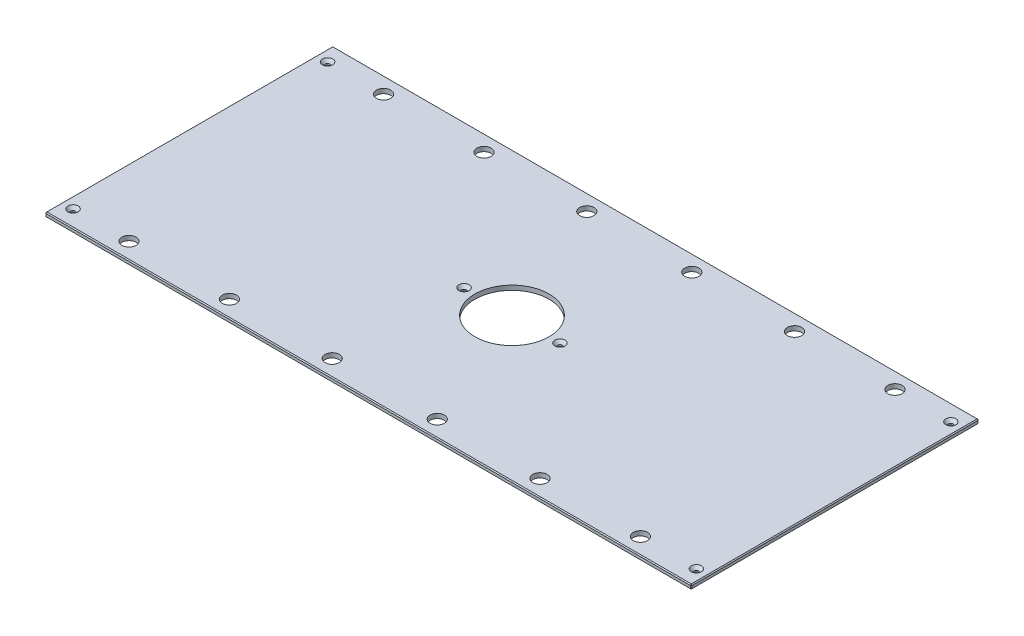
ISO-10303-21;
HEADER;
FILE_DESCRIPTION(('STEP AP214'),'2;1');
FILE_NAME('part.step','',(''),(''),'','','');
FILE_SCHEMA(('AUTOMOTIVE_DESIGN { 1 0 10303 214 1 1 1 1 }'));
ENDSEC;
DATA;
#1=APPLICATION_CONTEXT('core data for automotive mechanical design processes');
#2=APPLICATION_PROTOCOL_DEFINITION('international standard','automotive_design',2000,#1);
#3=PRODUCT_CONTEXT('',#1,'mechanical');
#4=PRODUCT('Part','Part','',(#3));
#5=PRODUCT_RELATED_PRODUCT_CATEGORY('part','',(#4));
#6=PRODUCT_DEFINITION_FORMATION('','',#4);
#7=PRODUCT_DEFINITION_CONTEXT('part definition',#1,'design');
#8=PRODUCT_DEFINITION('design','',#6,#7);
#9=PRODUCT_DEFINITION_SHAPE('','',#8);
#10=(LENGTH_UNIT() NAMED_UNIT(*) SI_UNIT(.MILLI.,.METRE.));
#11=(NAMED_UNIT(*) PLANE_ANGLE_UNIT() SI_UNIT($,.RADIAN.));
#12=(NAMED_UNIT(*) SI_UNIT($,.STERADIAN.) SOLID_ANGLE_UNIT());
#13=UNCERTAINTY_MEASURE_WITH_UNIT(LENGTH_MEASURE(1.E-05),#10,'distance_accuracy_value','');
#14=(GEOMETRIC_REPRESENTATION_CONTEXT(3) GLOBAL_UNCERTAINTY_ASSIGNED_CONTEXT((#13)) GLOBAL_UNIT_ASSIGNED_CONTEXT((#10,
#11,#12)) REPRESENTATION_CONTEXT('',''));
#15=CARTESIAN_POINT('',(0.,0.,0.));
#16=DIRECTION('',(0.,0.,1.));
#17=DIRECTION('',(1.,0.,0.));
#18=AXIS2_PLACEMENT_3D('',#15,#16,#17);
#19=CARTESIAN_POINT('',(-449.2625,6.35,-200.025));
#20=DIRECTION('',(1.,0.,0.));
#21=DIRECTION('',(0.,0.,-1.));
#22=AXIS2_PLACEMENT_3D('',#19,#20,#21);
#23=PLANE('',#22);
#24=DIRECTION('',(0.,0.,-1.));
#25=VECTOR('',#24,1.);
#26=CARTESIAN_POINT('',(-449.2625,5.08000000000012,-200.025));
#27=LINE('',#26,#25);
#28=CARTESIAN_POINT('',(-449.2625,5.08000000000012,198.755));
#29=VERTEX_POINT('',#28);
#30=CARTESIAN_POINT('',(-449.2625,5.08000000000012,-198.755));
#31=VERTEX_POINT('',#30);
#32=EDGE_CURVE('E136',#29,#31,#27,.T.);
#33=ORIENTED_EDGE('',*,*,#32,.T.);
#34=DIRECTION('',(0.,-1.,0.));
#35=VECTOR('',#34,1.);
#36=CARTESIAN_POINT('',(-449.2625,6.35,-198.755));
#37=LINE('',#36,#35);
#38=CARTESIAN_POINT('',(-449.2625,1.26999999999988,-198.755));
#39=VERTEX_POINT('',#38);
#40=EDGE_CURVE('E132',#31,#39,#37,.T.);
#41=ORIENTED_EDGE('',*,*,#40,.T.);
#42=DIRECTION('',(0.,0.,1.));
#43=VECTOR('',#42,1.);
#44=CARTESIAN_POINT('',(-449.2625,1.26999999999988,-200.025));
#45=LINE('',#44,#43);
#46=CARTESIAN_POINT('',(-449.2625,1.26999999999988,198.755));
#47=VERTEX_POINT('',#46);
#48=EDGE_CURVE('E127',#39,#47,#45,.T.);
#49=ORIENTED_EDGE('',*,*,#48,.T.);
#50=DIRECTION('',(0.,1.,0.));
#51=VECTOR('',#50,1.);
#52=CARTESIAN_POINT('',(-449.2625,6.35,198.755));
#53=LINE('',#52,#51);
#54=EDGE_CURVE('E129',#47,#29,#53,.T.);
#55=ORIENTED_EDGE('',*,*,#54,.T.);
#56=EDGE_LOOP('',(#33,#41,#49,#55));
#57=FACE_BOUND('',#56,.T.);
#58=ADVANCED_FACE('F36',(#57),#23,.F.);
#59=CARTESIAN_POINT('',(-449.2625,6.35,200.025));
#60=DIRECTION('',(0.,0.,-1.));
#61=DIRECTION('',(-1.,0.,0.));
#62=AXIS2_PLACEMENT_3D('',#59,#60,#61);
#63=PLANE('',#62);
#64=DIRECTION('',(1.,0.,0.));
#65=VECTOR('',#64,1.);
#66=CARTESIAN_POINT('',(-449.2625,1.26999999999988,200.025));
#67=LINE('',#66,#65);
#68=CARTESIAN_POINT('',(-447.9925,1.26999999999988,200.025));
#69=VERTEX_POINT('',#68);
#70=CARTESIAN_POINT('',(447.9925,1.26999999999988,200.025));
#71=VERTEX_POINT('',#70);
#72=EDGE_CURVE('E59',#69,#71,#67,.T.);
#73=ORIENTED_EDGE('',*,*,#72,.T.);
#74=DIRECTION('',(0.,1.,0.));
#75=VECTOR('',#74,1.);
#76=CARTESIAN_POINT('',(447.9925,6.35,200.025));
#77=LINE('',#76,#75);
#78=CARTESIAN_POINT('',(447.9925,5.08000000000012,200.025));
#79=VERTEX_POINT('',#78);
#80=EDGE_CURVE('E11',#71,#79,#77,.T.);
#81=ORIENTED_EDGE('',*,*,#80,.T.);
#82=DIRECTION('',(-1.,0.,0.));
#83=VECTOR('',#82,1.);
#84=CARTESIAN_POINT('',(-449.2625,5.08000000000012,200.025));
#85=LINE('',#84,#83);
#86=CARTESIAN_POINT('',(-447.9925,5.08000000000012,200.025));
#87=VERTEX_POINT('',#86);
#88=EDGE_CURVE('E45',#79,#87,#85,.T.);
#89=ORIENTED_EDGE('',*,*,#88,.T.);
#90=DIRECTION('',(0.,-1.,0.));
#91=VECTOR('',#90,1.);
#92=CARTESIAN_POINT('',(-447.9925,6.35,200.025));
#93=LINE('',#92,#91);
#94=EDGE_CURVE('E328',#87,#69,#93,.T.);
#95=ORIENTED_EDGE('',*,*,#94,.T.);
#96=EDGE_LOOP('',(#73,#81,#89,#95));
#97=FACE_BOUND('',#96,.T.);
#98=ADVANCED_FACE('F397',(#97),#63,.F.);
#99=CARTESIAN_POINT('',(449.2625,6.35,-200.025));
#100=DIRECTION('',(-1.,0.,0.));
#101=DIRECTION('',(0.,0.,1.));
#102=AXIS2_PLACEMENT_3D('',#99,#100,#101);
#103=PLANE('',#102);
#104=DIRECTION('',(0.,0.,-1.));
#105=VECTOR('',#104,1.);
#106=CARTESIAN_POINT('',(449.2625,1.26999999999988,-200.025));
#107=LINE('',#106,#105);
#108=CARTESIAN_POINT('',(449.2625,1.26999999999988,198.755));
#109=VERTEX_POINT('',#108);
#110=CARTESIAN_POINT('',(449.2625,1.26999999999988,-198.755));
#111=VERTEX_POINT('',#110);
#112=EDGE_CURVE('E323',#109,#111,#107,.T.);
#113=ORIENTED_EDGE('',*,*,#112,.T.);
#114=DIRECTION('',(0.,1.,0.));
#115=VECTOR('',#114,1.);
#116=CARTESIAN_POINT('',(449.2625,6.35,-198.755));
#117=LINE('',#116,#115);
#118=CARTESIAN_POINT('',(449.2625,5.08000000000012,-198.755));
#119=VERTEX_POINT('',#118);
#120=EDGE_CURVE('E325',#111,#119,#117,.T.);
#121=ORIENTED_EDGE('',*,*,#120,.T.);
#122=DIRECTION('',(0.,0.,1.));
#123=VECTOR('',#122,1.);
#124=CARTESIAN_POINT('',(449.2625,5.08000000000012,200.025));
#125=LINE('',#124,#123);
#126=CARTESIAN_POINT('',(449.2625,5.08000000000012,198.755));
#127=VERTEX_POINT('',#126);
#128=EDGE_CURVE('E321',#119,#127,#125,.T.);
#129=ORIENTED_EDGE('',*,*,#128,.T.);
#130=DIRECTION('',(0.,-1.,0.));
#131=VECTOR('',#130,1.);
#132=CARTESIAN_POINT('',(449.2625,6.35,198.755));
#133=LINE('',#132,#131);
#134=EDGE_CURVE('E319',#127,#109,#133,.T.);
#135=ORIENTED_EDGE('',*,*,#134,.T.);
#136=EDGE_LOOP('',(#113,#121,#129,#135));
#137=FACE_BOUND('',#136,.T.);
#138=ADVANCED_FACE('F384',(#137),#103,.F.);
#139=CARTESIAN_POINT('',(-449.2625,6.35,-200.025));
#140=DIRECTION('',(0.,0.,1.));
#141=DIRECTION('',(1.,0.,0.));
#142=AXIS2_PLACEMENT_3D('',#139,#140,#141);
#143=PLANE('',#142);
#144=DIRECTION('',(-1.,0.,0.));
#145=VECTOR('',#144,1.);
#146=CARTESIAN_POINT('',(-449.2625,1.26999999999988,-200.025));
#147=LINE('',#146,#145);
#148=CARTESIAN_POINT('',(447.9925,1.26999999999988,-200.025));
#149=VERTEX_POINT('',#148);
#150=CARTESIAN_POINT('',(-447.9925,1.26999999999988,-200.025));
#151=VERTEX_POINT('',#150);
#152=EDGE_CURVE('E295',#149,#151,#147,.T.);
#153=ORIENTED_EDGE('',*,*,#152,.T.);
#154=DIRECTION('',(0.,1.,0.));
#155=VECTOR('',#154,1.);
#156=CARTESIAN_POINT('',(-447.9925,6.35,-200.025));
#157=LINE('',#156,#155);
#158=CARTESIAN_POINT('',(-447.9925,5.08000000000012,-200.025));
#159=VERTEX_POINT('',#158);
#160=EDGE_CURVE('E299',#151,#159,#157,.T.);
#161=ORIENTED_EDGE('',*,*,#160,.T.);
#162=DIRECTION('',(1.,0.,0.));
#163=VECTOR('',#162,1.);
#164=CARTESIAN_POINT('',(449.2625,5.08000000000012,-200.025));
#165=LINE('',#164,#163);
#166=CARTESIAN_POINT('',(447.9925,5.08000000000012,-200.025));
#167=VERTEX_POINT('',#166);
#168=EDGE_CURVE('E297',#159,#167,#165,.T.);
#169=ORIENTED_EDGE('',*,*,#168,.T.);
#170=DIRECTION('',(0.,-1.,0.));
#171=VECTOR('',#170,1.);
#172=CARTESIAN_POINT('',(447.9925,6.35,-200.025));
#173=LINE('',#172,#171);
#174=EDGE_CURVE('E293',#167,#149,#173,.T.);
#175=ORIENTED_EDGE('',*,*,#174,.T.);
#176=EDGE_LOOP('',(#153,#161,#169,#175));
#177=FACE_BOUND('',#176,.T.);
#178=ADVANCED_FACE('F358',(#177),#143,.F.);
#179=CARTESIAN_POINT('',(0.,6.35,0.));
#180=DIRECTION('',(0.,1.,0.));
#181=DIRECTION('',(0.,0.,1.));
#182=AXIS2_PLACEMENT_3D('',#179,#180,#181);
#183=PLANE('',#182);
#184=CARTESIAN_POINT('',(433.3875,6.35,-177.00498));
#185=DIRECTION('',(0.,1.,0.));
#186=DIRECTION('',(0.,0.,1.));
#187=AXIS2_PLACEMENT_3D('',#184,#185,#186);
#188=CIRCLE('',#187,7.13740000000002);
#189=CARTESIAN_POINT('',(433.3875,6.35,-169.86758));
#190=VERTEX_POINT('',#189);
#191=EDGE_CURVE('E881',#190,#190,#188,.T.);
#192=ORIENTED_EDGE('',*,*,#191,.F.);
#193=EDGE_LOOP('',(#192));
#194=FACE_BOUND('',#193,.T.);
#195=CARTESIAN_POINT('',(433.3875,6.35,177.00498));
#196=DIRECTION('',(0.,1.,0.));
#197=DIRECTION('',(0.,0.,1.));
#198=AXIS2_PLACEMENT_3D('',#195,#196,#197);
#199=CIRCLE('',#198,7.13740000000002);
#200=CARTESIAN_POINT('',(433.3875,6.35,184.14238));
#201=VERTEX_POINT('',#200);
#202=EDGE_CURVE('E885',#201,#201,#199,.T.);
#203=ORIENTED_EDGE('',*,*,#202,.F.);
#204=EDGE_LOOP('',(#203));
#205=FACE_BOUND('',#204,.T.);
#206=CARTESIAN_POINT('',(-433.3875,6.35,177.00498));
#207=DIRECTION('',(0.,1.,0.));
#208=DIRECTION('',(0.,0.,1.));
#209=AXIS2_PLACEMENT_3D('',#206,#207,#208);
#210=CIRCLE('',#209,7.13740000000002);
#211=CARTESIAN_POINT('',(-433.3875,6.35,184.14238));
#212=VERTEX_POINT('',#211);
#213=EDGE_CURVE('E889',#212,#212,#210,.T.);
#214=ORIENTED_EDGE('',*,*,#213,.F.);
#215=EDGE_LOOP('',(#214));
#216=FACE_BOUND('',#215,.T.);
#217=CARTESIAN_POINT('',(-66.675,6.35,0.));
#218=DIRECTION('',(0.,1.,0.));
#219=DIRECTION('',(0.,0.,1.));
#220=AXIS2_PLACEMENT_3D('',#217,#218,#219);
#221=CIRCLE('',#220,7.1374);
#222=CARTESIAN_POINT('',(-66.675,6.35,7.1374));
#223=VERTEX_POINT('',#222);
#224=EDGE_CURVE('E893',#223,#223,#221,.T.);
#225=ORIENTED_EDGE('',*,*,#224,.F.);
#226=EDGE_LOOP('',(#225));
#227=FACE_BOUND('',#226,.T.);
#228=CARTESIAN_POINT('',(66.675,6.35,0.));
#229=DIRECTION('',(0.,1.,0.));
#230=DIRECTION('',(0.,0.,1.));
#231=AXIS2_PLACEMENT_3D('',#228,#229,#230);
#232=CIRCLE('',#231,7.1374);
#233=CARTESIAN_POINT('',(66.675,6.35,7.1374));
#234=VERTEX_POINT('',#233);
#235=EDGE_CURVE('E897',#234,#234,#232,.T.);
#236=ORIENTED_EDGE('',*,*,#235,.F.);
#237=EDGE_LOOP('',(#236));
#238=FACE_BOUND('',#237,.T.);
#239=CARTESIAN_POINT('',(-433.3875,6.35,-177.00498));
#240=DIRECTION('',(0.,1.,0.));
#241=DIRECTION('',(0.,0.,1.));
#242=AXIS2_PLACEMENT_3D('',#239,#240,#241);
#243=CIRCLE('',#242,7.13740000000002);
#244=CARTESIAN_POINT('',(-433.3875,6.35,-169.86758));
#245=VERTEX_POINT('',#244);
#246=EDGE_CURVE('E900',#245,#245,#243,.T.);
#247=ORIENTED_EDGE('',*,*,#246,.F.);
#248=EDGE_LOOP('',(#247));
#249=FACE_BOUND('',#248,.T.);
#250=DIRECTION('',(0.,0.,-1.));
#251=VECTOR('',#250,1.);
#252=CARTESIAN_POINT('',(447.9925,6.35,-200.025));
#253=LINE('',#252,#251);
#254=CARTESIAN_POINT('',(447.9925,6.35,198.755));
#255=VERTEX_POINT('',#254);
#256=CARTESIAN_POINT('',(447.9925,6.35,-198.755));
#257=VERTEX_POINT('',#256);
#258=EDGE_CURVE('E306',#255,#257,#253,.T.);
#259=ORIENTED_EDGE('',*,*,#258,.T.);
#260=DIRECTION('',(-1.,0.,0.));
#261=VECTOR('',#260,1.);
#262=CARTESIAN_POINT('',(-449.2625,6.35,-198.755));
#263=LINE('',#262,#261);
#264=CARTESIAN_POINT('',(-447.9925,6.35,-198.755));
#265=VERTEX_POINT('',#264);
#266=EDGE_CURVE('E308',#257,#265,#263,.T.);
#267=ORIENTED_EDGE('',*,*,#266,.T.);
#268=DIRECTION('',(0.,0.,1.));
#269=VECTOR('',#268,1.);
#270=CARTESIAN_POINT('',(-447.9925,6.35,200.025));
#271=LINE('',#270,#269);
#272=CARTESIAN_POINT('',(-447.9925,6.35,198.755));
#273=VERTEX_POINT('',#272);
#274=EDGE_CURVE('E304',#265,#273,#271,.T.);
#275=ORIENTED_EDGE('',*,*,#274,.T.);
#276=DIRECTION('',(1.,0.,0.));
#277=VECTOR('',#276,1.);
#278=CARTESIAN_POINT('',(449.2625,6.35,198.755));
#279=LINE('',#278,#277);
#280=EDGE_CURVE('E302',#273,#255,#279,.T.);
#281=ORIENTED_EDGE('',*,*,#280,.T.);
#282=EDGE_LOOP('',(#259,#267,#275,#281));
#283=FACE_BOUND('',#282,.T.);
#284=CARTESIAN_POINT('',(355.6,6.35,-177.00498));
#285=DIRECTION('',(0.,1.,0.));
#286=DIRECTION('',(0.,0.,1.));
#287=AXIS2_PLACEMENT_3D('',#284,#285,#286);
#288=CIRCLE('',#287,9.92187500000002);
#289=CARTESIAN_POINT('',(355.6,6.35,-167.083105));
#290=VERTEX_POINT('',#289);
#291=EDGE_CURVE('E205',#290,#290,#288,.T.);
#292=ORIENTED_EDGE('',*,*,#291,.F.);
#293=EDGE_LOOP('',(#292));
#294=FACE_BOUND('',#293,.T.);
#295=CARTESIAN_POINT('',(-355.6,6.35,-177.00498));
#296=DIRECTION('',(0.,1.,0.));
#297=DIRECTION('',(0.,0.,1.));
#298=AXIS2_PLACEMENT_3D('',#295,#296,#297);
#299=CIRCLE('',#298,9.92187500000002);
#300=CARTESIAN_POINT('',(-355.6,6.35,-167.083105));
#301=VERTEX_POINT('',#300);
#302=EDGE_CURVE('E215',#301,#301,#299,.T.);
#303=ORIENTED_EDGE('',*,*,#302,.F.);
#304=EDGE_LOOP('',(#303));
#305=FACE_BOUND('',#304,.T.);
#306=CARTESIAN_POINT('',(355.6,6.35,177.00498));
#307=DIRECTION('',(0.,1.,0.));
#308=DIRECTION('',(0.,0.,1.));
#309=AXIS2_PLACEMENT_3D('',#306,#307,#308);
#310=CIRCLE('',#309,9.92187500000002);
#311=CARTESIAN_POINT('',(355.6,6.35,186.926855));
#312=VERTEX_POINT('',#311);
#313=EDGE_CURVE('E226',#312,#312,#310,.T.);
#314=ORIENTED_EDGE('',*,*,#313,.F.);
#315=EDGE_LOOP('',(#314));
#316=FACE_BOUND('',#315,.T.);
#317=CARTESIAN_POINT('',(-355.6,6.35,177.00498));
#318=DIRECTION('',(0.,1.,0.));
#319=DIRECTION('',(0.,0.,1.));
#320=AXIS2_PLACEMENT_3D('',#317,#318,#319);
#321=CIRCLE('',#320,9.92187500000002);
#322=CARTESIAN_POINT('',(-355.6,6.35,186.926855));
#323=VERTEX_POINT('',#322);
#324=EDGE_CURVE('E232',#323,#323,#321,.T.);
#325=ORIENTED_EDGE('',*,*,#324,.F.);
#326=EDGE_LOOP('',(#325));
#327=FACE_BOUND('',#326,.T.);
#328=CARTESIAN_POINT('',(-215.9,6.35,-177.00498));
#329=DIRECTION('',(0.,1.,0.));
#330=DIRECTION('',(0.,0.,1.));
#331=AXIS2_PLACEMENT_3D('',#328,#329,#330);
#332=CIRCLE('',#331,9.921875);
#333=CARTESIAN_POINT('',(-215.9,6.35,-167.083105));
#334=VERTEX_POINT('',#333);
#335=EDGE_CURVE('E238',#334,#334,#332,.T.);
#336=ORIENTED_EDGE('',*,*,#335,.F.);
#337=EDGE_LOOP('',(#336));
#338=FACE_BOUND('',#337,.T.);
#339=CARTESIAN_POINT('',(215.9,6.35,-177.00498));
#340=DIRECTION('',(0.,1.,0.));
#341=DIRECTION('',(0.,0.,1.));
#342=AXIS2_PLACEMENT_3D('',#339,#340,#341);
#343=CIRCLE('',#342,9.921875);
#344=CARTESIAN_POINT('',(215.9,6.35,-167.083105));
#345=VERTEX_POINT('',#344);
#346=EDGE_CURVE('E244',#345,#345,#343,.T.);
#347=ORIENTED_EDGE('',*,*,#346,.F.);
#348=EDGE_LOOP('',(#347));
#349=FACE_BOUND('',#348,.T.);
#350=CARTESIAN_POINT('',(215.9,6.35,177.00498));
#351=DIRECTION('',(0.,1.,0.));
#352=DIRECTION('',(0.,0.,1.));
#353=AXIS2_PLACEMENT_3D('',#350,#351,#352);
#354=CIRCLE('',#353,9.921875);
#355=CARTESIAN_POINT('',(215.9,6.35,186.926855));
#356=VERTEX_POINT('',#355);
#357=EDGE_CURVE('E250',#356,#356,#354,.T.);
#358=ORIENTED_EDGE('',*,*,#357,.F.);
#359=EDGE_LOOP('',(#358));
#360=FACE_BOUND('',#359,.T.);
#361=CARTESIAN_POINT('',(-215.9,6.35,177.00498));
#362=DIRECTION('',(0.,1.,0.));
#363=DIRECTION('',(0.,0.,1.));
#364=AXIS2_PLACEMENT_3D('',#361,#362,#363);
#365=CIRCLE('',#364,9.921875);
#366=CARTESIAN_POINT('',(-215.9,6.35,186.926855));
#367=VERTEX_POINT('',#366);
#368=EDGE_CURVE('E256',#367,#367,#365,.T.);
#369=ORIENTED_EDGE('',*,*,#368,.F.);
#370=EDGE_LOOP('',(#369));
#371=FACE_BOUND('',#370,.T.);
#372=CARTESIAN_POINT('',(73.025,6.35,-177.00498));
#373=DIRECTION('',(0.,1.,0.));
#374=DIRECTION('',(0.,0.,1.));
#375=AXIS2_PLACEMENT_3D('',#372,#373,#374);
#376=CIRCLE('',#375,9.921875);
#377=CARTESIAN_POINT('',(73.025,6.35,-167.083105));
#378=VERTEX_POINT('',#377);
#379=EDGE_CURVE('E262',#378,#378,#376,.T.);
#380=ORIENTED_EDGE('',*,*,#379,.F.);
#381=EDGE_LOOP('',(#380));
#382=FACE_BOUND('',#381,.T.);
#383=CARTESIAN_POINT('',(-73.025,6.35,-177.00498));
#384=DIRECTION('',(0.,1.,0.));
#385=DIRECTION('',(0.,0.,1.));
#386=AXIS2_PLACEMENT_3D('',#383,#384,#385);
#387=CIRCLE('',#386,9.921875);
#388=CARTESIAN_POINT('',(-73.025,6.35,-167.083105));
#389=VERTEX_POINT('',#388);
#390=EDGE_CURVE('E268',#389,#389,#387,.T.);
#391=ORIENTED_EDGE('',*,*,#390,.F.);
#392=EDGE_LOOP('',(#391));
#393=FACE_BOUND('',#392,.T.);
#394=CARTESIAN_POINT('',(-73.025,6.35,177.00498));
#395=DIRECTION('',(0.,1.,0.));
#396=DIRECTION('',(0.,0.,1.));
#397=AXIS2_PLACEMENT_3D('',#394,#395,#396);
#398=CIRCLE('',#397,9.921875);
#399=CARTESIAN_POINT('',(-73.025,6.35,186.926855));
#400=VERTEX_POINT('',#399);
#401=EDGE_CURVE('E274',#400,#400,#398,.T.);
#402=ORIENTED_EDGE('',*,*,#401,.F.);
#403=EDGE_LOOP('',(#402));
#404=FACE_BOUND('',#403,.T.);
#405=CARTESIAN_POINT('',(73.025,6.35,177.00498));
#406=DIRECTION('',(0.,1.,0.));
#407=DIRECTION('',(0.,0.,1.));
#408=AXIS2_PLACEMENT_3D('',#405,#406,#407);
#409=CIRCLE('',#408,9.921875);
#410=CARTESIAN_POINT('',(73.025,6.35,186.926855));
#411=VERTEX_POINT('',#410);
#412=EDGE_CURVE('E280',#411,#411,#409,.T.);
#413=ORIENTED_EDGE('',*,*,#412,.F.);
#414=EDGE_LOOP('',(#413));
#415=FACE_BOUND('',#414,.T.);
#416=CARTESIAN_POINT('',(0.,6.35,0.));
#417=DIRECTION('',(0.,1.,0.));
#418=DIRECTION('',(0.,0.,1.));
#419=AXIS2_PLACEMENT_3D('',#416,#417,#418);
#420=CIRCLE('',#419,51.562);
#421=CARTESIAN_POINT('',(0.,6.35,51.562));
#422=VERTEX_POINT('',#421);
#423=EDGE_CURVE('E286',#422,#422,#420,.T.);
#424=ORIENTED_EDGE('',*,*,#423,.F.);
#425=EDGE_LOOP('',(#424));
#426=FACE_BOUND('',#425,.T.);
#427=ADVANCED_FACE('F406',(#194,#205,#216,#227,#238,#249,#283,#294,#305,#316,#327,#338,#349,
#360,#371,#382,#393,#404,#415,#426),#183,.T.);
#428=CARTESIAN_POINT('',(0.,0.,0.));
#429=DIRECTION('',(0.,1.,0.));
#430=DIRECTION('',(0.,0.,1.));
#431=AXIS2_PLACEMENT_3D('',#428,#429,#430);
#432=PLANE('',#431);
#433=CARTESIAN_POINT('',(433.3875,0.,-177.00498));
#434=DIRECTION('',(0.,1.,0.));
#435=DIRECTION('',(0.,0.,1.));
#436=AXIS2_PLACEMENT_3D('',#433,#434,#435);
#437=CIRCLE('',#436,3.3782);
#438=CARTESIAN_POINT('',(433.3875,0.,-173.62678));
#439=VERTEX_POINT('',#438);
#440=EDGE_CURVE('E934',#439,#439,#437,.T.);
#441=ORIENTED_EDGE('',*,*,#440,.T.);
#442=EDGE_LOOP('',(#441));
#443=FACE_BOUND('',#442,.T.);
#444=CARTESIAN_POINT('',(433.3875,0.,177.00498));
#445=DIRECTION('',(0.,1.,0.));
#446=DIRECTION('',(0.,0.,1.));
#447=AXIS2_PLACEMENT_3D('',#444,#445,#446);
#448=CIRCLE('',#447,3.3782);
#449=CARTESIAN_POINT('',(433.3875,0.,180.38318));
#450=VERTEX_POINT('',#449);
#451=EDGE_CURVE('E927',#450,#450,#448,.T.);
#452=ORIENTED_EDGE('',*,*,#451,.T.);
#453=EDGE_LOOP('',(#452));
#454=FACE_BOUND('',#453,.T.);
#455=CARTESIAN_POINT('',(-433.3875,0.,177.00498));
#456=DIRECTION('',(0.,1.,0.));
#457=DIRECTION('',(0.,0.,1.));
#458=AXIS2_PLACEMENT_3D('',#455,#456,#457);
#459=CIRCLE('',#458,3.3782);
#460=CARTESIAN_POINT('',(-433.3875,0.,180.38318));
#461=VERTEX_POINT('',#460);
#462=EDGE_CURVE('E920',#461,#461,#459,.T.);
#463=ORIENTED_EDGE('',*,*,#462,.T.);
#464=EDGE_LOOP('',(#463));
#465=FACE_BOUND('',#464,.T.);
#466=CARTESIAN_POINT('',(-66.675,0.,0.));
#467=DIRECTION('',(0.,1.,0.));
#468=DIRECTION('',(0.,0.,1.));
#469=AXIS2_PLACEMENT_3D('',#466,#467,#468);
#470=CIRCLE('',#469,3.3782);
#471=CARTESIAN_POINT('',(-66.675,0.,3.3782));
#472=VERTEX_POINT('',#471);
#473=EDGE_CURVE('E913',#472,#472,#470,.T.);
#474=ORIENTED_EDGE('',*,*,#473,.T.);
#475=EDGE_LOOP('',(#474));
#476=FACE_BOUND('',#475,.T.);
#477=CARTESIAN_POINT('',(66.675,0.,0.));
#478=DIRECTION('',(0.,1.,0.));
#479=DIRECTION('',(0.,0.,1.));
#480=AXIS2_PLACEMENT_3D('',#477,#478,#479);
#481=CIRCLE('',#480,3.3782);
#482=CARTESIAN_POINT('',(66.675,0.,3.3782));
#483=VERTEX_POINT('',#482);
#484=EDGE_CURVE('E903',#483,#483,#481,.T.);
#485=ORIENTED_EDGE('',*,*,#484,.T.);
#486=EDGE_LOOP('',(#485));
#487=FACE_BOUND('',#486,.T.);
#488=CARTESIAN_POINT('',(-433.3875,0.,-177.00498));
#489=DIRECTION('',(0.,1.,0.));
#490=DIRECTION('',(0.,0.,1.));
#491=AXIS2_PLACEMENT_3D('',#488,#489,#490);
#492=CIRCLE('',#491,3.3782);
#493=CARTESIAN_POINT('',(-433.3875,0.,-173.62678));
#494=VERTEX_POINT('',#493);
#495=EDGE_CURVE('E218',#494,#494,#492,.T.);
#496=ORIENTED_EDGE('',*,*,#495,.T.);
#497=EDGE_LOOP('',(#496));
#498=FACE_BOUND('',#497,.T.);
#499=DIRECTION('',(0.,0.,-1.));
#500=VECTOR('',#499,1.);
#501=CARTESIAN_POINT('',(-447.9925,0.,0.));
#502=LINE('',#501,#500);
#503=CARTESIAN_POINT('',(-447.9925,0.,198.755));
#504=VERTEX_POINT('',#503);
#505=CARTESIAN_POINT('',(-447.9925,0.,-198.755));
#506=VERTEX_POINT('',#505);
#507=EDGE_CURVE('E159',#504,#506,#502,.T.);
#508=ORIENTED_EDGE('',*,*,#507,.T.);
#509=DIRECTION('',(1.,0.,0.));
#510=VECTOR('',#509,1.);
#511=CARTESIAN_POINT('',(0.,0.,-198.755));
#512=LINE('',#511,#510);
#513=CARTESIAN_POINT('',(447.9925,0.,-198.755));
#514=VERTEX_POINT('',#513);
#515=EDGE_CURVE('E316',#506,#514,#512,.T.);
#516=ORIENTED_EDGE('',*,*,#515,.T.);
#517=DIRECTION('',(0.,0.,1.));
#518=VECTOR('',#517,1.);
#519=CARTESIAN_POINT('',(447.9925,0.,0.));
#520=LINE('',#519,#518);
#521=CARTESIAN_POINT('',(447.9925,0.,198.755));
#522=VERTEX_POINT('',#521);
#523=EDGE_CURVE('E314',#514,#522,#520,.T.);
#524=ORIENTED_EDGE('',*,*,#523,.T.);
#525=DIRECTION('',(-1.,0.,0.));
#526=VECTOR('',#525,1.);
#527=CARTESIAN_POINT('',(0.,0.,198.755));
#528=LINE('',#527,#526);
#529=EDGE_CURVE('E311',#522,#504,#528,.T.);
#530=ORIENTED_EDGE('',*,*,#529,.T.);
#531=EDGE_LOOP('',(#508,#516,#524,#530));
#532=FACE_BOUND('',#531,.T.);
#533=CARTESIAN_POINT('',(355.6,0.,-177.00498));
#534=DIRECTION('',(0.,1.,0.));
#535=DIRECTION('',(0.,0.,1.));
#536=AXIS2_PLACEMENT_3D('',#533,#534,#535);
#537=CIRCLE('',#536,9.92187499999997);
#538=CARTESIAN_POINT('',(355.6,0.,-167.083105));
#539=VERTEX_POINT('',#538);
#540=EDGE_CURVE('E210',#539,#539,#537,.T.);
#541=ORIENTED_EDGE('',*,*,#540,.T.);
#542=EDGE_LOOP('',(#541));
#543=FACE_BOUND('',#542,.T.);
#544=CARTESIAN_POINT('',(-355.6,0.,-177.00498));
#545=DIRECTION('',(0.,1.,0.));
#546=DIRECTION('',(0.,0.,1.));
#547=AXIS2_PLACEMENT_3D('',#544,#545,#546);
#548=CIRCLE('',#547,9.92187499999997);
#549=CARTESIAN_POINT('',(-355.6,0.,-167.083105));
#550=VERTEX_POINT('',#549);
#551=EDGE_CURVE('E223',#550,#550,#548,.T.);
#552=ORIENTED_EDGE('',*,*,#551,.T.);
#553=EDGE_LOOP('',(#552));
#554=FACE_BOUND('',#553,.T.);
#555=CARTESIAN_POINT('',(355.6,0.,177.00498));
#556=DIRECTION('',(0.,1.,0.));
#557=DIRECTION('',(0.,0.,1.));
#558=AXIS2_PLACEMENT_3D('',#555,#556,#557);
#559=CIRCLE('',#558,9.92187499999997);
#560=CARTESIAN_POINT('',(355.6,0.,186.926855));
#561=VERTEX_POINT('',#560);
#562=EDGE_CURVE('E229',#561,#561,#559,.T.);
#563=ORIENTED_EDGE('',*,*,#562,.T.);
#564=EDGE_LOOP('',(#563));
#565=FACE_BOUND('',#564,.T.);
#566=CARTESIAN_POINT('',(-355.6,0.,177.00498));
#567=DIRECTION('',(0.,1.,0.));
#568=DIRECTION('',(0.,0.,1.));
#569=AXIS2_PLACEMENT_3D('',#566,#567,#568);
#570=CIRCLE('',#569,9.92187499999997);
#571=CARTESIAN_POINT('',(-355.6,0.,186.926855));
#572=VERTEX_POINT('',#571);
#573=EDGE_CURVE('E235',#572,#572,#570,.T.);
#574=ORIENTED_EDGE('',*,*,#573,.T.);
#575=EDGE_LOOP('',(#574));
#576=FACE_BOUND('',#575,.T.);
#577=CARTESIAN_POINT('',(-215.9,0.,-177.00498));
#578=DIRECTION('',(0.,1.,0.));
#579=DIRECTION('',(0.,0.,1.));
#580=AXIS2_PLACEMENT_3D('',#577,#578,#579);
#581=CIRCLE('',#580,9.921875);
#582=CARTESIAN_POINT('',(-215.9,0.,-167.083105));
#583=VERTEX_POINT('',#582);
#584=EDGE_CURVE('E241',#583,#583,#581,.T.);
#585=ORIENTED_EDGE('',*,*,#584,.T.);
#586=EDGE_LOOP('',(#585));
#587=FACE_BOUND('',#586,.T.);
#588=CARTESIAN_POINT('',(215.9,0.,-177.00498));
#589=DIRECTION('',(0.,1.,0.));
#590=DIRECTION('',(0.,0.,1.));
#591=AXIS2_PLACEMENT_3D('',#588,#589,#590);
#592=CIRCLE('',#591,9.921875);
#593=CARTESIAN_POINT('',(215.9,0.,-167.083105));
#594=VERTEX_POINT('',#593);
#595=EDGE_CURVE('E247',#594,#594,#592,.T.);
#596=ORIENTED_EDGE('',*,*,#595,.T.);
#597=EDGE_LOOP('',(#596));
#598=FACE_BOUND('',#597,.T.);
#599=CARTESIAN_POINT('',(215.9,0.,177.00498));
#600=DIRECTION('',(0.,1.,0.));
#601=DIRECTION('',(0.,0.,1.));
#602=AXIS2_PLACEMENT_3D('',#599,#600,#601);
#603=CIRCLE('',#602,9.921875);
#604=CARTESIAN_POINT('',(215.9,0.,186.926855));
#605=VERTEX_POINT('',#604);
#606=EDGE_CURVE('E253',#605,#605,#603,.T.);
#607=ORIENTED_EDGE('',*,*,#606,.T.);
#608=EDGE_LOOP('',(#607));
#609=FACE_BOUND('',#608,.T.);
#610=CARTESIAN_POINT('',(-215.9,0.,177.00498));
#611=DIRECTION('',(0.,1.,0.));
#612=DIRECTION('',(0.,0.,1.));
#613=AXIS2_PLACEMENT_3D('',#610,#611,#612);
#614=CIRCLE('',#613,9.921875);
#615=CARTESIAN_POINT('',(-215.9,0.,186.926855));
#616=VERTEX_POINT('',#615);
#617=EDGE_CURVE('E259',#616,#616,#614,.T.);
#618=ORIENTED_EDGE('',*,*,#617,.T.);
#619=EDGE_LOOP('',(#618));
#620=FACE_BOUND('',#619,.T.);
#621=CARTESIAN_POINT('',(73.025,0.,-177.00498));
#622=DIRECTION('',(0.,1.,0.));
#623=DIRECTION('',(0.,0.,1.));
#624=AXIS2_PLACEMENT_3D('',#621,#622,#623);
#625=CIRCLE('',#624,9.921875);
#626=CARTESIAN_POINT('',(73.025,0.,-167.083105));
#627=VERTEX_POINT('',#626);
#628=EDGE_CURVE('E265',#627,#627,#625,.T.);
#629=ORIENTED_EDGE('',*,*,#628,.T.);
#630=EDGE_LOOP('',(#629));
#631=FACE_BOUND('',#630,.T.);
#632=CARTESIAN_POINT('',(-73.025,0.,-177.00498));
#633=DIRECTION('',(0.,1.,0.));
#634=DIRECTION('',(0.,0.,1.));
#635=AXIS2_PLACEMENT_3D('',#632,#633,#634);
#636=CIRCLE('',#635,9.921875);
#637=CARTESIAN_POINT('',(-73.025,0.,-167.083105));
#638=VERTEX_POINT('',#637);
#639=EDGE_CURVE('E271',#638,#638,#636,.T.);
#640=ORIENTED_EDGE('',*,*,#639,.T.);
#641=EDGE_LOOP('',(#640));
#642=FACE_BOUND('',#641,.T.);
#643=CARTESIAN_POINT('',(-73.025,0.,177.00498));
#644=DIRECTION('',(0.,1.,0.));
#645=DIRECTION('',(0.,0.,1.));
#646=AXIS2_PLACEMENT_3D('',#643,#644,#645);
#647=CIRCLE('',#646,9.921875);
#648=CARTESIAN_POINT('',(-73.025,0.,186.926855));
#649=VERTEX_POINT('',#648);
#650=EDGE_CURVE('E277',#649,#649,#647,.T.);
#651=ORIENTED_EDGE('',*,*,#650,.T.);
#652=EDGE_LOOP('',(#651));
#653=FACE_BOUND('',#652,.T.);
#654=CARTESIAN_POINT('',(73.025,0.,177.00498));
#655=DIRECTION('',(0.,1.,0.));
#656=DIRECTION('',(0.,0.,1.));
#657=AXIS2_PLACEMENT_3D('',#654,#655,#656);
#658=CIRCLE('',#657,9.921875);
#659=CARTESIAN_POINT('',(73.025,0.,186.926855));
#660=VERTEX_POINT('',#659);
#661=EDGE_CURVE('E283',#660,#660,#658,.T.);
#662=ORIENTED_EDGE('',*,*,#661,.T.);
#663=EDGE_LOOP('',(#662));
#664=FACE_BOUND('',#663,.T.);
#665=CARTESIAN_POINT('',(0.,0.,0.));
#666=DIRECTION('',(0.,1.,0.));
#667=DIRECTION('',(0.,0.,1.));
#668=AXIS2_PLACEMENT_3D('',#665,#666,#667);
#669=CIRCLE('',#668,51.562);
#670=CARTESIAN_POINT('',(0.,0.,51.562));
#671=VERTEX_POINT('',#670);
#672=EDGE_CURVE('E148',#671,#671,#669,.T.);
#673=ORIENTED_EDGE('',*,*,#672,.T.);
#674=EDGE_LOOP('',(#673));
#675=FACE_BOUND('',#674,.T.);
#676=ADVANCED_FACE('F371',(#443,#454,#465,#476,#487,#498,#532,#543,#554,#565,#576,#587,#598,
#609,#620,#631,#642,#653,#664,#675),#432,.F.);
#677=CARTESIAN_POINT('',(0.,0.,0.));
#678=DIRECTION('',(0.,1.,0.));
#679=DIRECTION('',(0.,0.,1.));
#680=AXIS2_PLACEMENT_3D('',#677,#678,#679);
#681=CYLINDRICAL_SURFACE('',#680,51.562);
#682=ORIENTED_EDGE('',*,*,#672,.F.);
#683=EDGE_LOOP('',(#682));
#684=FACE_BOUND('',#683,.T.);
#685=ORIENTED_EDGE('',*,*,#423,.T.);
#686=EDGE_LOOP('',(#685));
#687=FACE_BOUND('',#686,.T.);
#688=ADVANCED_FACE('F812',(#684,#687),#681,.F.);
#689=CARTESIAN_POINT('',(73.025,6.35,177.00498));
#690=DIRECTION('',(0.,1.,0.));
#691=DIRECTION('',(0.,0.,1.));
#692=AXIS2_PLACEMENT_3D('',#689,#690,#691);
#693=CYLINDRICAL_SURFACE('',#692,9.921875);
#694=ORIENTED_EDGE('',*,*,#661,.F.);
#695=EDGE_LOOP('',(#694));
#696=FACE_BOUND('',#695,.T.);
#697=ORIENTED_EDGE('',*,*,#412,.T.);
#698=EDGE_LOOP('',(#697));
#699=FACE_BOUND('',#698,.T.);
#700=ADVANCED_FACE('F803',(#696,#699),#693,.F.);
#701=CARTESIAN_POINT('',(-73.025,6.35,177.00498));
#702=DIRECTION('',(0.,1.,0.));
#703=DIRECTION('',(0.,0.,1.));
#704=AXIS2_PLACEMENT_3D('',#701,#702,#703);
#705=CYLINDRICAL_SURFACE('',#704,9.921875);
#706=ORIENTED_EDGE('',*,*,#650,.F.);
#707=EDGE_LOOP('',(#706));
#708=FACE_BOUND('',#707,.T.);
#709=ORIENTED_EDGE('',*,*,#401,.T.);
#710=EDGE_LOOP('',(#709));
#711=FACE_BOUND('',#710,.T.);
#712=ADVANCED_FACE('F794',(#708,#711),#705,.F.);
#713=CARTESIAN_POINT('',(-73.025,6.35,-177.00498));
#714=DIRECTION('',(0.,1.,0.));
#715=DIRECTION('',(0.,0.,1.));
#716=AXIS2_PLACEMENT_3D('',#713,#714,#715);
#717=CYLINDRICAL_SURFACE('',#716,9.921875);
#718=ORIENTED_EDGE('',*,*,#639,.F.);
#719=EDGE_LOOP('',(#718));
#720=FACE_BOUND('',#719,.T.);
#721=ORIENTED_EDGE('',*,*,#390,.T.);
#722=EDGE_LOOP('',(#721));
#723=FACE_BOUND('',#722,.T.);
#724=ADVANCED_FACE('F785',(#720,#723),#717,.F.);
#725=CARTESIAN_POINT('',(73.025,6.35,-177.00498));
#726=DIRECTION('',(0.,1.,0.));
#727=DIRECTION('',(0.,0.,1.));
#728=AXIS2_PLACEMENT_3D('',#725,#726,#727);
#729=CYLINDRICAL_SURFACE('',#728,9.921875);
#730=ORIENTED_EDGE('',*,*,#628,.F.);
#731=EDGE_LOOP('',(#730));
#732=FACE_BOUND('',#731,.T.);
#733=ORIENTED_EDGE('',*,*,#379,.T.);
#734=EDGE_LOOP('',(#733));
#735=FACE_BOUND('',#734,.T.);
#736=ADVANCED_FACE('F776',(#732,#735),#729,.F.);
#737=CARTESIAN_POINT('',(-215.9,6.35,177.00498));
#738=DIRECTION('',(0.,1.,0.));
#739=DIRECTION('',(0.,0.,1.));
#740=AXIS2_PLACEMENT_3D('',#737,#738,#739);
#741=CYLINDRICAL_SURFACE('',#740,9.921875);
#742=ORIENTED_EDGE('',*,*,#617,.F.);
#743=EDGE_LOOP('',(#742));
#744=FACE_BOUND('',#743,.T.);
#745=ORIENTED_EDGE('',*,*,#368,.T.);
#746=EDGE_LOOP('',(#745));
#747=FACE_BOUND('',#746,.T.);
#748=ADVANCED_FACE('F767',(#744,#747),#741,.F.);
#749=CARTESIAN_POINT('',(215.9,6.35,177.00498));
#750=DIRECTION('',(0.,1.,0.));
#751=DIRECTION('',(0.,0.,1.));
#752=AXIS2_PLACEMENT_3D('',#749,#750,#751);
#753=CYLINDRICAL_SURFACE('',#752,9.921875);
#754=ORIENTED_EDGE('',*,*,#606,.F.);
#755=EDGE_LOOP('',(#754));
#756=FACE_BOUND('',#755,.T.);
#757=ORIENTED_EDGE('',*,*,#357,.T.);
#758=EDGE_LOOP('',(#757));
#759=FACE_BOUND('',#758,.T.);
#760=ADVANCED_FACE('F758',(#756,#759),#753,.F.);
#761=CARTESIAN_POINT('',(215.9,6.35,-177.00498));
#762=DIRECTION('',(0.,1.,0.));
#763=DIRECTION('',(0.,0.,1.));
#764=AXIS2_PLACEMENT_3D('',#761,#762,#763);
#765=CYLINDRICAL_SURFACE('',#764,9.921875);
#766=ORIENTED_EDGE('',*,*,#595,.F.);
#767=EDGE_LOOP('',(#766));
#768=FACE_BOUND('',#767,.T.);
#769=ORIENTED_EDGE('',*,*,#346,.T.);
#770=EDGE_LOOP('',(#769));
#771=FACE_BOUND('',#770,.T.);
#772=ADVANCED_FACE('F749',(#768,#771),#765,.F.);
#773=CARTESIAN_POINT('',(-215.9,6.35,-177.00498));
#774=DIRECTION('',(0.,1.,0.));
#775=DIRECTION('',(0.,0.,1.));
#776=AXIS2_PLACEMENT_3D('',#773,#774,#775);
#777=CYLINDRICAL_SURFACE('',#776,9.921875);
#778=ORIENTED_EDGE('',*,*,#584,.F.);
#779=EDGE_LOOP('',(#778));
#780=FACE_BOUND('',#779,.T.);
#781=ORIENTED_EDGE('',*,*,#335,.T.);
#782=EDGE_LOOP('',(#781));
#783=FACE_BOUND('',#782,.T.);
#784=ADVANCED_FACE('F740',(#780,#783),#777,.F.);
#785=CARTESIAN_POINT('',(-355.6,6.35,177.00498));
#786=DIRECTION('',(0.,1.,0.));
#787=DIRECTION('',(0.,0.,1.));
#788=AXIS2_PLACEMENT_3D('',#785,#786,#787);
#789=CYLINDRICAL_SURFACE('',#788,9.921875);
#790=ORIENTED_EDGE('',*,*,#573,.F.);
#791=EDGE_LOOP('',(#790));
#792=FACE_BOUND('',#791,.T.);
#793=ORIENTED_EDGE('',*,*,#324,.T.);
#794=EDGE_LOOP('',(#793));
#795=FACE_BOUND('',#794,.T.);
#796=ADVANCED_FACE('F731',(#792,#795),#789,.F.);
#797=CARTESIAN_POINT('',(355.6,6.35,177.00498));
#798=DIRECTION('',(0.,1.,0.));
#799=DIRECTION('',(0.,0.,1.));
#800=AXIS2_PLACEMENT_3D('',#797,#798,#799);
#801=CYLINDRICAL_SURFACE('',#800,9.921875);
#802=ORIENTED_EDGE('',*,*,#562,.F.);
#803=EDGE_LOOP('',(#802));
#804=FACE_BOUND('',#803,.T.);
#805=ORIENTED_EDGE('',*,*,#313,.T.);
#806=EDGE_LOOP('',(#805));
#807=FACE_BOUND('',#806,.T.);
#808=ADVANCED_FACE('F722',(#804,#807),#801,.F.);
#809=CARTESIAN_POINT('',(-355.6,6.35,-177.00498));
#810=DIRECTION('',(0.,1.,0.));
#811=DIRECTION('',(0.,0.,1.));
#812=AXIS2_PLACEMENT_3D('',#809,#810,#811);
#813=CYLINDRICAL_SURFACE('',#812,9.921875);
#814=ORIENTED_EDGE('',*,*,#551,.F.);
#815=EDGE_LOOP('',(#814));
#816=FACE_BOUND('',#815,.T.);
#817=ORIENTED_EDGE('',*,*,#302,.T.);
#818=EDGE_LOOP('',(#817));
#819=FACE_BOUND('',#818,.T.);
#820=ADVANCED_FACE('F712',(#816,#819),#813,.F.);
#821=CARTESIAN_POINT('',(355.6,6.35,-177.00498));
#822=DIRECTION('',(0.,1.,0.));
#823=DIRECTION('',(0.,0.,1.));
#824=AXIS2_PLACEMENT_3D('',#821,#822,#823);
#825=CYLINDRICAL_SURFACE('',#824,9.921875);
#826=ORIENTED_EDGE('',*,*,#540,.F.);
#827=EDGE_LOOP('',(#826));
#828=FACE_BOUND('',#827,.T.);
#829=ORIENTED_EDGE('',*,*,#291,.T.);
#830=EDGE_LOOP('',(#829));
#831=FACE_BOUND('',#830,.T.);
#832=ADVANCED_FACE('F415',(#828,#831),#825,.F.);
#833=CARTESIAN_POINT('',(449.2625,6.35,198.755));
#834=DIRECTION('',(-0.707106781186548,0.,-0.707106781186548));
#835=DIRECTION('',(0.,-1.,0.));
#836=AXIS2_PLACEMENT_3D('',#833,#834,#835);
#837=PLANE('',#836);
#838=DIRECTION('',(-0.707106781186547,0.,0.707106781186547));
#839=VECTOR('',#838,1.);
#840=CARTESIAN_POINT('',(449.2625,5.08000000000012,198.755));
#841=LINE('',#840,#839);
#842=EDGE_CURVE('E40',#79,#127,#841,.F.);
#843=ORIENTED_EDGE('',*,*,#842,.F.);
#844=ORIENTED_EDGE('',*,*,#80,.F.);
#845=DIRECTION('',(0.707106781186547,0.,-0.707106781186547));
#846=VECTOR('',#845,1.);
#847=CARTESIAN_POINT('',(448.6275,1.26999999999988,199.39));
#848=LINE('',#847,#846);
#849=EDGE_CURVE('E198',#109,#71,#848,.F.);
#850=ORIENTED_EDGE('',*,*,#849,.F.);
#851=ORIENTED_EDGE('',*,*,#134,.F.);
#852=EDGE_LOOP('',(#843,#844,#850,#851));
#853=FACE_BOUND('',#852,.T.);
#854=ADVANCED_FACE('F38',(#853),#837,.F.);
#855=CARTESIAN_POINT('',(449.2625,5.08000000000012,198.755));
#856=DIRECTION('',(0.577350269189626,0.577350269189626,0.577350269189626));
#857=DIRECTION('',(0.707106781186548,0.,-0.707106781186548));
#858=AXIS2_PLACEMENT_3D('',#855,#856,#857);
#859=PLANE('',#858);
#860=DIRECTION('',(0.,-0.707106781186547,0.707106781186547));
#861=VECTOR('',#860,1.);
#862=CARTESIAN_POINT('',(447.9925,5.71500000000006,199.39));
#863=LINE('',#862,#861);
#864=EDGE_CURVE('E194',#79,#255,#863,.F.);
#865=ORIENTED_EDGE('',*,*,#864,.F.);
#866=ORIENTED_EDGE('',*,*,#842,.T.);
#867=DIRECTION('',(-0.707106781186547,0.707106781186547,0.));
#868=VECTOR('',#867,1.);
#869=CARTESIAN_POINT('',(449.2625,5.08000000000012,198.755));
#870=LINE('',#869,#868);
#871=EDGE_CURVE('E196',#255,#127,#870,.F.);
#872=ORIENTED_EDGE('',*,*,#871,.F.);
#873=EDGE_LOOP('',(#865,#866,#872));
#874=FACE_BOUND('',#873,.T.);
#875=ADVANCED_FACE('F408',(#874),#859,.T.);
#876=CARTESIAN_POINT('',(447.9925,0.,198.755));
#877=DIRECTION('',(0.577350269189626,-0.577350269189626,0.577350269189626));
#878=DIRECTION('',(0.707106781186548,0.,-0.707106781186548));
#879=AXIS2_PLACEMENT_3D('',#876,#877,#878);
#880=PLANE('',#879);
#881=DIRECTION('',(-0.707106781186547,-0.707106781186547,0.));
#882=VECTOR('',#881,1.);
#883=CARTESIAN_POINT('',(447.9925,0.,198.755));
#884=LINE('',#883,#882);
#885=EDGE_CURVE('E188',#109,#522,#884,.T.);
#886=ORIENTED_EDGE('',*,*,#885,.F.);
#887=ORIENTED_EDGE('',*,*,#849,.T.);
#888=DIRECTION('',(0.,0.707106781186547,0.707106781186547));
#889=VECTOR('',#888,1.);
#890=CARTESIAN_POINT('',(447.9925,0.,198.755));
#891=LINE('',#890,#889);
#892=EDGE_CURVE('E191',#522,#71,#891,.T.);
#893=ORIENTED_EDGE('',*,*,#892,.F.);
#894=EDGE_LOOP('',(#886,#887,#893));
#895=FACE_BOUND('',#894,.T.);
#896=ADVANCED_FACE('F377',(#895),#880,.T.);
#897=CARTESIAN_POINT('',(447.9925,6.35,0.));
#898=DIRECTION('',(0.707106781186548,0.707106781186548,0.));
#899=DIRECTION('',(0.,0.,1.));
#900=AXIS2_PLACEMENT_3D('',#897,#898,#899);
#901=PLANE('',#900);
#902=ORIENTED_EDGE('',*,*,#871,.T.);
#903=ORIENTED_EDGE('',*,*,#128,.F.);
#904=DIRECTION('',(0.707106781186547,-0.707106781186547,0.));
#905=VECTOR('',#904,1.);
#906=CARTESIAN_POINT('',(448.6275,5.71500000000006,-198.755));
#907=LINE('',#906,#905);
#908=EDGE_CURVE('E183',#257,#119,#907,.T.);
#909=ORIENTED_EDGE('',*,*,#908,.F.);
#910=ORIENTED_EDGE('',*,*,#258,.F.);
#911=EDGE_LOOP('',(#902,#903,#909,#910));
#912=FACE_BOUND('',#911,.T.);
#913=ADVANCED_FACE('F394',(#912),#901,.T.);
#914=CARTESIAN_POINT('',(0.,6.35,198.755));
#915=DIRECTION('',(0.,0.707106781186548,0.707106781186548));
#916=DIRECTION('',(-1.,0.,0.));
#917=AXIS2_PLACEMENT_3D('',#914,#915,#916);
#918=PLANE('',#917);
#919=ORIENTED_EDGE('',*,*,#864,.T.);
#920=ORIENTED_EDGE('',*,*,#280,.F.);
#921=DIRECTION('',(0.,0.707106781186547,-0.707106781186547));
#922=VECTOR('',#921,1.);
#923=CARTESIAN_POINT('',(-447.9925,6.35,198.755));
#924=LINE('',#923,#922);
#925=EDGE_CURVE('E180',#87,#273,#924,.T.);
#926=ORIENTED_EDGE('',*,*,#925,.F.);
#927=ORIENTED_EDGE('',*,*,#88,.F.);
#928=EDGE_LOOP('',(#919,#920,#926,#927));
#929=FACE_BOUND('',#928,.T.);
#930=ADVANCED_FACE('F399',(#929),#918,.T.);
#931=CARTESIAN_POINT('',(-447.9925,6.35,200.025));
#932=DIRECTION('',(0.707106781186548,0.,-0.707106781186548));
#933=DIRECTION('',(0.,-1.,0.));
#934=AXIS2_PLACEMENT_3D('',#931,#932,#933);
#935=PLANE('',#934);
#936=DIRECTION('',(0.707106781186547,0.,0.707106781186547));
#937=VECTOR('',#936,1.);
#938=CARTESIAN_POINT('',(-449.2625,1.26999999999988,198.755));
#939=LINE('',#938,#937);
#940=EDGE_CURVE('E143',#69,#47,#939,.F.);
#941=ORIENTED_EDGE('',*,*,#940,.F.);
#942=ORIENTED_EDGE('',*,*,#94,.F.);
#943=DIRECTION('',(-0.707106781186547,0.,-0.707106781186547));
#944=VECTOR('',#943,1.);
#945=CARTESIAN_POINT('',(-448.6275,5.08000000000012,199.39));
#946=LINE('',#945,#944);
#947=EDGE_CURVE('E146',#29,#87,#946,.F.);
#948=ORIENTED_EDGE('',*,*,#947,.F.);
#949=ORIENTED_EDGE('',*,*,#54,.F.);
#950=EDGE_LOOP('',(#941,#942,#948,#949));
#951=FACE_BOUND('',#950,.T.);
#952=ADVANCED_FACE('F141',(#951),#935,.F.);
#953=CARTESIAN_POINT('',(-449.2625,1.26999999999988,200.025));
#954=DIRECTION('',(0.,0.707106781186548,-0.707106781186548));
#955=DIRECTION('',(1.,0.,0.));
#956=AXIS2_PLACEMENT_3D('',#953,#954,#955);
#957=PLANE('',#956);
#958=ORIENTED_EDGE('',*,*,#892,.T.);
#959=ORIENTED_EDGE('',*,*,#72,.F.);
#960=DIRECTION('',(0.,-0.707106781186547,-0.707106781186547));
#961=VECTOR('',#960,1.);
#962=CARTESIAN_POINT('',(-447.9925,0.634999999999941,199.39));
#963=LINE('',#962,#961);
#964=EDGE_CURVE('E156',#504,#69,#963,.F.);
#965=ORIENTED_EDGE('',*,*,#964,.F.);
#966=ORIENTED_EDGE('',*,*,#529,.F.);
#967=EDGE_LOOP('',(#958,#959,#965,#966));
#968=FACE_BOUND('',#967,.T.);
#969=ADVANCED_FACE('F376',(#968),#957,.F.);
#970=CARTESIAN_POINT('',(449.2625,1.26999999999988,-200.025));
#971=DIRECTION('',(-0.707106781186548,0.707106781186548,0.));
#972=DIRECTION('',(0.,0.,-1.));
#973=AXIS2_PLACEMENT_3D('',#970,#971,#972);
#974=PLANE('',#973);
#975=ORIENTED_EDGE('',*,*,#885,.T.);
#976=ORIENTED_EDGE('',*,*,#523,.F.);
#977=DIRECTION('',(0.707106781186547,0.707106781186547,0.));
#978=VECTOR('',#977,1.);
#979=CARTESIAN_POINT('',(447.9925,0.,-198.755));
#980=LINE('',#979,#978);
#981=EDGE_CURVE('E175',#111,#514,#980,.F.);
#982=ORIENTED_EDGE('',*,*,#981,.F.);
#983=ORIENTED_EDGE('',*,*,#112,.F.);
#984=EDGE_LOOP('',(#975,#976,#982,#983));
#985=FACE_BOUND('',#984,.T.);
#986=ADVANCED_FACE('F381',(#985),#974,.F.);
#987=CARTESIAN_POINT('',(447.9925,6.35,-200.025));
#988=DIRECTION('',(-0.707106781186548,0.,0.707106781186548));
#989=DIRECTION('',(0.,-1.,0.));
#990=AXIS2_PLACEMENT_3D('',#987,#988,#989);
#991=PLANE('',#990);
#992=DIRECTION('',(0.707106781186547,0.,0.707106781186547));
#993=VECTOR('',#992,1.);
#994=CARTESIAN_POINT('',(447.9925,5.08000000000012,-200.025));
#995=LINE('',#994,#993);
#996=EDGE_CURVE('E185',#119,#167,#995,.F.);
#997=ORIENTED_EDGE('',*,*,#996,.F.);
#998=ORIENTED_EDGE('',*,*,#120,.F.);
#999=DIRECTION('',(-0.707106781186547,0.,-0.707106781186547));
#1000=VECTOR('',#999,1.);
#1001=CARTESIAN_POINT('',(448.6275,1.26999999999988,-199.39));
#1002=LINE('',#1001,#1000);
#1003=EDGE_CURVE('E172',#149,#111,#1002,.F.);
#1004=ORIENTED_EDGE('',*,*,#1003,.F.);
#1005=ORIENTED_EDGE('',*,*,#174,.F.);
#1006=EDGE_LOOP('',(#997,#998,#1004,#1005));
#1007=FACE_BOUND('',#1006,.T.);
#1008=ADVANCED_FACE('F389',(#1007),#991,.F.);
#1009=CARTESIAN_POINT('',(447.9925,5.08000000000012,-200.025));
#1010=DIRECTION('',(0.577350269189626,0.577350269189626,-0.577350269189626));
#1011=DIRECTION('',(-0.707106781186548,0.,-0.707106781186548));
#1012=AXIS2_PLACEMENT_3D('',#1009,#1010,#1011);
#1013=PLANE('',#1012);
#1014=ORIENTED_EDGE('',*,*,#908,.T.);
#1015=ORIENTED_EDGE('',*,*,#996,.T.);
#1016=DIRECTION('',(0.,0.707106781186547,0.707106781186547));
#1017=VECTOR('',#1016,1.);
#1018=CARTESIAN_POINT('',(447.9925,5.08000000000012,-200.025));
#1019=LINE('',#1018,#1017);
#1020=EDGE_CURVE('E164',#257,#167,#1019,.F.);
#1021=ORIENTED_EDGE('',*,*,#1020,.F.);
#1022=EDGE_LOOP('',(#1014,#1015,#1021));
#1023=FACE_BOUND('',#1022,.T.);
#1024=ADVANCED_FACE('F447',(#1023),#1013,.T.);
#1025=CARTESIAN_POINT('',(-447.9925,6.35,198.755));
#1026=DIRECTION('',(-0.577350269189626,0.577350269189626,0.577350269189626));
#1027=DIRECTION('',(0.707106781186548,0.,0.707106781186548));
#1028=AXIS2_PLACEMENT_3D('',#1025,#1026,#1027);
#1029=PLANE('',#1028);
#1030=ORIENTED_EDGE('',*,*,#947,.T.);
#1031=ORIENTED_EDGE('',*,*,#925,.T.);
#1032=DIRECTION('',(-0.707106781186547,-0.707106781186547,0.));
#1033=VECTOR('',#1032,1.);
#1034=CARTESIAN_POINT('',(-447.9925,6.35,198.755));
#1035=LINE('',#1034,#1033);
#1036=EDGE_CURVE('E160',#29,#273,#1035,.F.);
#1037=ORIENTED_EDGE('',*,*,#1036,.F.);
#1038=EDGE_LOOP('',(#1030,#1031,#1037));
#1039=FACE_BOUND('',#1038,.T.);
#1040=ADVANCED_FACE('F401',(#1039),#1029,.T.);
#1041=CARTESIAN_POINT('',(-449.2625,1.26999999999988,198.755));
#1042=DIRECTION('',(-0.577350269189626,-0.577350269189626,0.577350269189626));
#1043=DIRECTION('',(0.707106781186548,0.,0.707106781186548));
#1044=AXIS2_PLACEMENT_3D('',#1041,#1042,#1043);
#1045=PLANE('',#1044);
#1046=ORIENTED_EDGE('',*,*,#964,.T.);
#1047=ORIENTED_EDGE('',*,*,#940,.T.);
#1048=DIRECTION('',(-0.707106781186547,0.707106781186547,0.));
#1049=VECTOR('',#1048,1.);
#1050=CARTESIAN_POINT('',(-449.2625,1.26999999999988,198.755));
#1051=LINE('',#1050,#1049);
#1052=EDGE_CURVE('E153',#504,#47,#1051,.T.);
#1053=ORIENTED_EDGE('',*,*,#1052,.F.);
#1054=EDGE_LOOP('',(#1046,#1047,#1053));
#1055=FACE_BOUND('',#1054,.T.);
#1056=ADVANCED_FACE('F152',(#1055),#1045,.T.);
#1057=CARTESIAN_POINT('',(447.9925,0.,-198.755));
#1058=DIRECTION('',(0.577350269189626,-0.577350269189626,-0.577350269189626));
#1059=DIRECTION('',(-0.707106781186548,0.,-0.707106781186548));
#1060=AXIS2_PLACEMENT_3D('',#1057,#1058,#1059);
#1061=PLANE('',#1060);
#1062=ORIENTED_EDGE('',*,*,#1003,.T.);
#1063=ORIENTED_EDGE('',*,*,#981,.T.);
#1064=DIRECTION('',(0.,-0.707106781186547,0.707106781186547));
#1065=VECTOR('',#1064,1.);
#1066=CARTESIAN_POINT('',(447.9925,0.,-198.755));
#1067=LINE('',#1066,#1065);
#1068=EDGE_CURVE('E161',#149,#514,#1067,.T.);
#1069=ORIENTED_EDGE('',*,*,#1068,.F.);
#1070=EDGE_LOOP('',(#1062,#1063,#1069));
#1071=FACE_BOUND('',#1070,.T.);
#1072=ADVANCED_FACE('F439',(#1071),#1061,.T.);
#1073=CARTESIAN_POINT('',(0.,6.35,-198.755));
#1074=DIRECTION('',(0.,0.707106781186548,-0.707106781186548));
#1075=DIRECTION('',(1.,0.,0.));
#1076=AXIS2_PLACEMENT_3D('',#1073,#1074,#1075);
#1077=PLANE('',#1076);
#1078=ORIENTED_EDGE('',*,*,#1020,.T.);
#1079=ORIENTED_EDGE('',*,*,#168,.F.);
#1080=DIRECTION('',(0.,-0.707106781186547,-0.707106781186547));
#1081=VECTOR('',#1080,1.);
#1082=CARTESIAN_POINT('',(-447.9925,5.08000000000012,-200.025));
#1083=LINE('',#1082,#1081);
#1084=EDGE_CURVE('E166',#265,#159,#1083,.T.);
#1085=ORIENTED_EDGE('',*,*,#1084,.F.);
#1086=ORIENTED_EDGE('',*,*,#266,.F.);
#1087=EDGE_LOOP('',(#1078,#1079,#1085,#1086));
#1088=FACE_BOUND('',#1087,.T.);
#1089=ADVANCED_FACE('F353',(#1088),#1077,.T.);
#1090=CARTESIAN_POINT('',(-447.9925,6.35,0.));
#1091=DIRECTION('',(-0.707106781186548,0.707106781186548,0.));
#1092=DIRECTION('',(0.,0.,-1.));
#1093=AXIS2_PLACEMENT_3D('',#1090,#1091,#1092);
#1094=PLANE('',#1093);
#1095=ORIENTED_EDGE('',*,*,#1036,.T.);
#1096=ORIENTED_EDGE('',*,*,#274,.F.);
#1097=DIRECTION('',(0.707106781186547,0.707106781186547,0.));
#1098=VECTOR('',#1097,1.);
#1099=CARTESIAN_POINT('',(-448.6275,5.71500000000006,-198.755));
#1100=LINE('',#1099,#1098);
#1101=EDGE_CURVE('E342',#31,#265,#1100,.T.);
#1102=ORIENTED_EDGE('',*,*,#1101,.F.);
#1103=ORIENTED_EDGE('',*,*,#32,.F.);
#1104=EDGE_LOOP('',(#1095,#1096,#1102,#1103));
#1105=FACE_BOUND('',#1104,.T.);
#1106=ADVANCED_FACE('F404',(#1105),#1094,.T.);
#1107=CARTESIAN_POINT('',(-449.2625,1.26999999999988,-200.025));
#1108=DIRECTION('',(0.707106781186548,0.707106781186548,0.));
#1109=DIRECTION('',(0.,0.,1.));
#1110=AXIS2_PLACEMENT_3D('',#1107,#1108,#1109);
#1111=PLANE('',#1110);
#1112=ORIENTED_EDGE('',*,*,#1052,.T.);
#1113=ORIENTED_EDGE('',*,*,#48,.F.);
#1114=DIRECTION('',(0.707106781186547,-0.707106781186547,0.));
#1115=VECTOR('',#1114,1.);
#1116=CARTESIAN_POINT('',(-449.2625,1.26999999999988,-198.755));
#1117=LINE('',#1116,#1115);
#1118=EDGE_CURVE('E339',#506,#39,#1117,.F.);
#1119=ORIENTED_EDGE('',*,*,#1118,.F.);
#1120=ORIENTED_EDGE('',*,*,#507,.F.);
#1121=EDGE_LOOP('',(#1112,#1113,#1119,#1120));
#1122=FACE_BOUND('',#1121,.T.);
#1123=ADVANCED_FACE('F158',(#1122),#1111,.F.);
#1124=CARTESIAN_POINT('',(-449.2625,1.26999999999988,-200.025));
#1125=DIRECTION('',(0.,0.707106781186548,0.707106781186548));
#1126=DIRECTION('',(-1.,0.,0.));
#1127=AXIS2_PLACEMENT_3D('',#1124,#1125,#1126);
#1128=PLANE('',#1127);
#1129=ORIENTED_EDGE('',*,*,#1068,.T.);
#1130=ORIENTED_EDGE('',*,*,#515,.F.);
#1131=DIRECTION('',(0.,0.707106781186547,-0.707106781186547));
#1132=VECTOR('',#1131,1.);
#1133=CARTESIAN_POINT('',(-447.9925,0.634999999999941,-199.39));
#1134=LINE('',#1133,#1132);
#1135=EDGE_CURVE('E336',#151,#506,#1134,.F.);
#1136=ORIENTED_EDGE('',*,*,#1135,.F.);
#1137=ORIENTED_EDGE('',*,*,#152,.F.);
#1138=EDGE_LOOP('',(#1129,#1130,#1136,#1137));
#1139=FACE_BOUND('',#1138,.T.);
#1140=ADVANCED_FACE('F368',(#1139),#1128,.F.);
#1141=CARTESIAN_POINT('',(-447.9925,5.08000000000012,-200.025));
#1142=DIRECTION('',(-0.577350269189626,0.577350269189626,-0.577350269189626));
#1143=DIRECTION('',(-0.707106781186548,0.,0.707106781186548));
#1144=AXIS2_PLACEMENT_3D('',#1141,#1142,#1143);
#1145=PLANE('',#1144);
#1146=ORIENTED_EDGE('',*,*,#1101,.T.);
#1147=ORIENTED_EDGE('',*,*,#1084,.T.);
#1148=DIRECTION('',(0.707106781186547,0.,-0.707106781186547));
#1149=VECTOR('',#1148,1.);
#1150=CARTESIAN_POINT('',(-447.9925,5.08000000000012,-200.025));
#1151=LINE('',#1150,#1149);
#1152=EDGE_CURVE('E334',#31,#159,#1151,.T.);
#1153=ORIENTED_EDGE('',*,*,#1152,.F.);
#1154=EDGE_LOOP('',(#1146,#1147,#1153));
#1155=FACE_BOUND('',#1154,.T.);
#1156=ADVANCED_FACE('F348',(#1155),#1145,.T.);
#1157=CARTESIAN_POINT('',(-449.2625,1.26999999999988,-198.755));
#1158=DIRECTION('',(-0.577350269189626,-0.577350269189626,-0.577350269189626));
#1159=DIRECTION('',(-0.707106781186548,0.,0.707106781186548));
#1160=AXIS2_PLACEMENT_3D('',#1157,#1158,#1159);
#1161=PLANE('',#1160);
#1162=ORIENTED_EDGE('',*,*,#1135,.T.);
#1163=ORIENTED_EDGE('',*,*,#1118,.T.);
#1164=DIRECTION('',(-0.707106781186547,0.,0.707106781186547));
#1165=VECTOR('',#1164,1.);
#1166=CARTESIAN_POINT('',(-449.2625,1.26999999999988,-198.755));
#1167=LINE('',#1166,#1165);
#1168=EDGE_CURVE('E332',#151,#39,#1167,.T.);
#1169=ORIENTED_EDGE('',*,*,#1168,.F.);
#1170=EDGE_LOOP('',(#1162,#1163,#1169));
#1171=FACE_BOUND('',#1170,.T.);
#1172=ADVANCED_FACE('F365',(#1171),#1161,.T.);
#1173=CARTESIAN_POINT('',(-449.2625,6.35,-198.755));
#1174=DIRECTION('',(0.707106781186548,0.,0.707106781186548));
#1175=DIRECTION('',(0.,-1.,0.));
#1176=AXIS2_PLACEMENT_3D('',#1173,#1174,#1175);
#1177=PLANE('',#1176);
#1178=ORIENTED_EDGE('',*,*,#1152,.T.);
#1179=ORIENTED_EDGE('',*,*,#160,.F.);
#1180=ORIENTED_EDGE('',*,*,#1168,.T.);
#1181=ORIENTED_EDGE('',*,*,#40,.F.);
#1182=EDGE_LOOP('',(#1178,#1179,#1180,#1181));
#1183=FACE_BOUND('',#1182,.T.);
#1184=ADVANCED_FACE('F363',(#1183),#1177,.F.);
#1185=CARTESIAN_POINT('',(-433.3875,6.35,-177.00498));
#1186=DIRECTION('',(0.,1.,0.));
#1187=DIRECTION('',(0.,0.,1.));
#1188=AXIS2_PLACEMENT_3D('',#1185,#1186,#1187);
#1189=CYLINDRICAL_SURFACE('',#1188,3.3782);
#1190=ORIENTED_EDGE('',*,*,#495,.F.);
#1191=EDGE_LOOP('',(#1190));
#1192=FACE_BOUND('',#1191,.T.);
#1193=CARTESIAN_POINT('',(-433.3875,2.02553508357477,-177.00498));
#1194=DIRECTION('',(0.,1.,0.));
#1195=DIRECTION('',(0.,0.,1.));
#1196=AXIS2_PLACEMENT_3D('',#1193,#1194,#1195);
#1197=CIRCLE('',#1196,3.3782);
#1198=CARTESIAN_POINT('',(-433.3875,2.02553508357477,-173.62678));
#1199=VERTEX_POINT('',#1198);
#1200=EDGE_CURVE('E902',#1199,#1199,#1197,.T.);
#1201=ORIENTED_EDGE('',*,*,#1200,.T.);
#1202=EDGE_LOOP('',(#1201));
#1203=FACE_BOUND('',#1202,.T.);
#1204=ADVANCED_FACE('F426',(#1192,#1203),#1189,.F.);
#1205=CARTESIAN_POINT('',(-433.3875,6.35,-177.00498));
#1206=DIRECTION('',(0.,1.,0.));
#1207=DIRECTION('',(0.,0.,1.));
#1208=AXIS2_PLACEMENT_3D('',#1205,#1206,#1207);
#1209=CONICAL_SURFACE('',#1208,7.13740000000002,0.715584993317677);
#1210=ORIENTED_EDGE('',*,*,#1200,.F.);
#1211=EDGE_LOOP('',(#1210));
#1212=FACE_BOUND('',#1211,.T.);
#1213=ORIENTED_EDGE('',*,*,#246,.T.);
#1214=EDGE_LOOP('',(#1213));
#1215=FACE_BOUND('',#1214,.T.);
#1216=ADVANCED_FACE('F536',(#1212,#1215),#1209,.F.);
#1217=CARTESIAN_POINT('',(66.675,6.35,0.));
#1218=DIRECTION('',(0.,1.,0.));
#1219=DIRECTION('',(0.,0.,1.));
#1220=AXIS2_PLACEMENT_3D('',#1217,#1218,#1219);
#1221=CYLINDRICAL_SURFACE('',#1220,3.3782);
#1222=ORIENTED_EDGE('',*,*,#484,.F.);
#1223=EDGE_LOOP('',(#1222));
#1224=FACE_BOUND('',#1223,.T.);
#1225=CARTESIAN_POINT('',(66.675,2.02553508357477,0.));
#1226=DIRECTION('',(0.,1.,0.));
#1227=DIRECTION('',(0.,0.,1.));
#1228=AXIS2_PLACEMENT_3D('',#1225,#1226,#1227);
#1229=CIRCLE('',#1228,3.3782);
#1230=CARTESIAN_POINT('',(66.675,2.02553508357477,3.3782));
#1231=VERTEX_POINT('',#1230);
#1232=EDGE_CURVE('E907',#1231,#1231,#1229,.T.);
#1233=ORIENTED_EDGE('',*,*,#1232,.T.);
#1234=EDGE_LOOP('',(#1233));
#1235=FACE_BOUND('',#1234,.T.);
#1236=ADVANCED_FACE('F545',(#1224,#1235),#1221,.F.);
#1237=CARTESIAN_POINT('',(66.675,6.35,0.));
#1238=DIRECTION('',(0.,1.,0.));
#1239=DIRECTION('',(0.,0.,1.));
#1240=AXIS2_PLACEMENT_3D('',#1237,#1238,#1239);
#1241=CONICAL_SURFACE('',#1240,7.1374,0.715584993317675);
#1242=ORIENTED_EDGE('',*,*,#1232,.F.);
#1243=EDGE_LOOP('',(#1242));
#1244=FACE_BOUND('',#1243,.T.);
#1245=ORIENTED_EDGE('',*,*,#235,.T.);
#1246=EDGE_LOOP('',(#1245));
#1247=FACE_BOUND('',#1246,.T.);
#1248=ADVANCED_FACE('F553',(#1244,#1247),#1241,.F.);
#1249=CARTESIAN_POINT('',(-66.675,6.35,0.));
#1250=DIRECTION('',(0.,1.,0.));
#1251=DIRECTION('',(0.,0.,1.));
#1252=AXIS2_PLACEMENT_3D('',#1249,#1250,#1251);
#1253=CYLINDRICAL_SURFACE('',#1252,3.3782);
#1254=ORIENTED_EDGE('',*,*,#473,.F.);
#1255=EDGE_LOOP('',(#1254));
#1256=FACE_BOUND('',#1255,.T.);
#1257=CARTESIAN_POINT('',(-66.675,2.02553508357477,0.));
#1258=DIRECTION('',(0.,1.,0.));
#1259=DIRECTION('',(0.,0.,1.));
#1260=AXIS2_PLACEMENT_3D('',#1257,#1258,#1259);
#1261=CIRCLE('',#1260,3.3782);
#1262=CARTESIAN_POINT('',(-66.675,2.02553508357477,3.3782));
#1263=VERTEX_POINT('',#1262);
#1264=EDGE_CURVE('E916',#1263,#1263,#1261,.T.);
#1265=ORIENTED_EDGE('',*,*,#1264,.T.);
#1266=EDGE_LOOP('',(#1265));
#1267=FACE_BOUND('',#1266,.T.);
#1268=ADVANCED_FACE('F561',(#1256,#1267),#1253,.F.);
#1269=CARTESIAN_POINT('',(-66.675,6.35,0.));
#1270=DIRECTION('',(0.,1.,0.));
#1271=DIRECTION('',(0.,0.,1.));
#1272=AXIS2_PLACEMENT_3D('',#1269,#1270,#1271);
#1273=CONICAL_SURFACE('',#1272,7.1374,0.715584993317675);
#1274=ORIENTED_EDGE('',*,*,#1264,.F.);
#1275=EDGE_LOOP('',(#1274));
#1276=FACE_BOUND('',#1275,.T.);
#1277=ORIENTED_EDGE('',*,*,#224,.T.);
#1278=EDGE_LOOP('',(#1277));
#1279=FACE_BOUND('',#1278,.T.);
#1280=ADVANCED_FACE('F569',(#1276,#1279),#1273,.F.);
#1281=CARTESIAN_POINT('',(-433.3875,6.35,177.00498));
#1282=DIRECTION('',(0.,1.,0.));
#1283=DIRECTION('',(0.,0.,1.));
#1284=AXIS2_PLACEMENT_3D('',#1281,#1282,#1283);
#1285=CYLINDRICAL_SURFACE('',#1284,3.3782);
#1286=ORIENTED_EDGE('',*,*,#462,.F.);
#1287=EDGE_LOOP('',(#1286));
#1288=FACE_BOUND('',#1287,.T.);
#1289=CARTESIAN_POINT('',(-433.3875,2.02553508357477,177.00498));
#1290=DIRECTION('',(0.,1.,0.));
#1291=DIRECTION('',(0.,0.,1.));
#1292=AXIS2_PLACEMENT_3D('',#1289,#1290,#1291);
#1293=CIRCLE('',#1292,3.3782);
#1294=CARTESIAN_POINT('',(-433.3875,2.02553508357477,180.38318));
#1295=VERTEX_POINT('',#1294);
#1296=EDGE_CURVE('E923',#1295,#1295,#1293,.T.);
#1297=ORIENTED_EDGE('',*,*,#1296,.T.);
#1298=EDGE_LOOP('',(#1297));
#1299=FACE_BOUND('',#1298,.T.);
#1300=ADVANCED_FACE('F577',(#1288,#1299),#1285,.F.);
#1301=CARTESIAN_POINT('',(-433.3875,6.35,177.00498));
#1302=DIRECTION('',(0.,1.,0.));
#1303=DIRECTION('',(0.,0.,1.));
#1304=AXIS2_PLACEMENT_3D('',#1301,#1302,#1303);
#1305=CONICAL_SURFACE('',#1304,7.13740000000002,0.715584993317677);
#1306=ORIENTED_EDGE('',*,*,#1296,.F.);
#1307=EDGE_LOOP('',(#1306));
#1308=FACE_BOUND('',#1307,.T.);
#1309=ORIENTED_EDGE('',*,*,#213,.T.);
#1310=EDGE_LOOP('',(#1309));
#1311=FACE_BOUND('',#1310,.T.);
#1312=ADVANCED_FACE('F585',(#1308,#1311),#1305,.F.);
#1313=CARTESIAN_POINT('',(433.3875,6.35,177.00498));
#1314=DIRECTION('',(0.,1.,0.));
#1315=DIRECTION('',(0.,0.,1.));
#1316=AXIS2_PLACEMENT_3D('',#1313,#1314,#1315);
#1317=CYLINDRICAL_SURFACE('',#1316,3.3782);
#1318=ORIENTED_EDGE('',*,*,#451,.F.);
#1319=EDGE_LOOP('',(#1318));
#1320=FACE_BOUND('',#1319,.T.);
#1321=CARTESIAN_POINT('',(433.3875,2.02553508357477,177.00498));
#1322=DIRECTION('',(0.,1.,0.));
#1323=DIRECTION('',(0.,0.,1.));
#1324=AXIS2_PLACEMENT_3D('',#1321,#1322,#1323);
#1325=CIRCLE('',#1324,3.3782);
#1326=CARTESIAN_POINT('',(433.3875,2.02553508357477,180.38318));
#1327=VERTEX_POINT('',#1326);
#1328=EDGE_CURVE('E930',#1327,#1327,#1325,.T.);
#1329=ORIENTED_EDGE('',*,*,#1328,.T.);
#1330=EDGE_LOOP('',(#1329));
#1331=FACE_BOUND('',#1330,.T.);
#1332=ADVANCED_FACE('F593',(#1320,#1331),#1317,.F.);
#1333=CARTESIAN_POINT('',(433.3875,6.35,177.00498));
#1334=DIRECTION('',(0.,1.,0.));
#1335=DIRECTION('',(0.,0.,1.));
#1336=AXIS2_PLACEMENT_3D('',#1333,#1334,#1335);
#1337=CONICAL_SURFACE('',#1336,7.13740000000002,0.715584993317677);
#1338=ORIENTED_EDGE('',*,*,#1328,.F.);
#1339=EDGE_LOOP('',(#1338));
#1340=FACE_BOUND('',#1339,.T.);
#1341=ORIENTED_EDGE('',*,*,#202,.T.);
#1342=EDGE_LOOP('',(#1341));
#1343=FACE_BOUND('',#1342,.T.);
#1344=ADVANCED_FACE('F601',(#1340,#1343),#1337,.F.);
#1345=CARTESIAN_POINT('',(433.3875,6.35,-177.00498));
#1346=DIRECTION('',(0.,1.,0.));
#1347=DIRECTION('',(0.,0.,1.));
#1348=AXIS2_PLACEMENT_3D('',#1345,#1346,#1347);
#1349=CYLINDRICAL_SURFACE('',#1348,3.3782);
#1350=ORIENTED_EDGE('',*,*,#440,.F.);
#1351=EDGE_LOOP('',(#1350));
#1352=FACE_BOUND('',#1351,.T.);
#1353=CARTESIAN_POINT('',(433.3875,2.02553508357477,-177.00498));
#1354=DIRECTION('',(0.,1.,0.));
#1355=DIRECTION('',(0.,0.,1.));
#1356=AXIS2_PLACEMENT_3D('',#1353,#1354,#1355);
#1357=CIRCLE('',#1356,3.3782);
#1358=CARTESIAN_POINT('',(433.3875,2.02553508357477,-173.62678));
#1359=VERTEX_POINT('',#1358);
#1360=EDGE_CURVE('E937',#1359,#1359,#1357,.T.);
#1361=ORIENTED_EDGE('',*,*,#1360,.T.);
#1362=EDGE_LOOP('',(#1361));
#1363=FACE_BOUND('',#1362,.T.);
#1364=ADVANCED_FACE('F609',(#1352,#1363),#1349,.F.);
#1365=CARTESIAN_POINT('',(433.3875,6.35,-177.00498));
#1366=DIRECTION('',(0.,1.,0.));
#1367=DIRECTION('',(0.,0.,1.));
#1368=AXIS2_PLACEMENT_3D('',#1365,#1366,#1367);
#1369=CONICAL_SURFACE('',#1368,7.13740000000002,0.715584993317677);
#1370=ORIENTED_EDGE('',*,*,#1360,.F.);
#1371=EDGE_LOOP('',(#1370));
#1372=FACE_BOUND('',#1371,.T.);
#1373=ORIENTED_EDGE('',*,*,#191,.T.);
#1374=EDGE_LOOP('',(#1373));
#1375=FACE_BOUND('',#1374,.T.);
#1376=ADVANCED_FACE('F617',(#1372,#1375),#1369,.F.);
#1377=CLOSED_SHELL('',(#58,#98,#138,#178,#427,#676,#688,#700,#712,#724,#736,#748,#760,#772,#784,
#796,#808,#820,#832,#854,#875,#896,#913,#930,#952,#969,#986,#1008,#1024,#1040,#1056,#1072,#1089,
#1106,#1123,#1140,#1156,#1172,#1184,#1204,#1216,#1236,#1248,#1268,#1280,#1300,#1312,#1332,#1344,
#1364,#1376));
#1378=MANIFOLD_SOLID_BREP('B2',#1377);
#1379=ADVANCED_BREP_SHAPE_REPRESENTATION('',(#18,#1378),#14);
#1380=SHAPE_DEFINITION_REPRESENTATION(#9,#1379);
ENDSEC;
END-ISO-10303-21;
